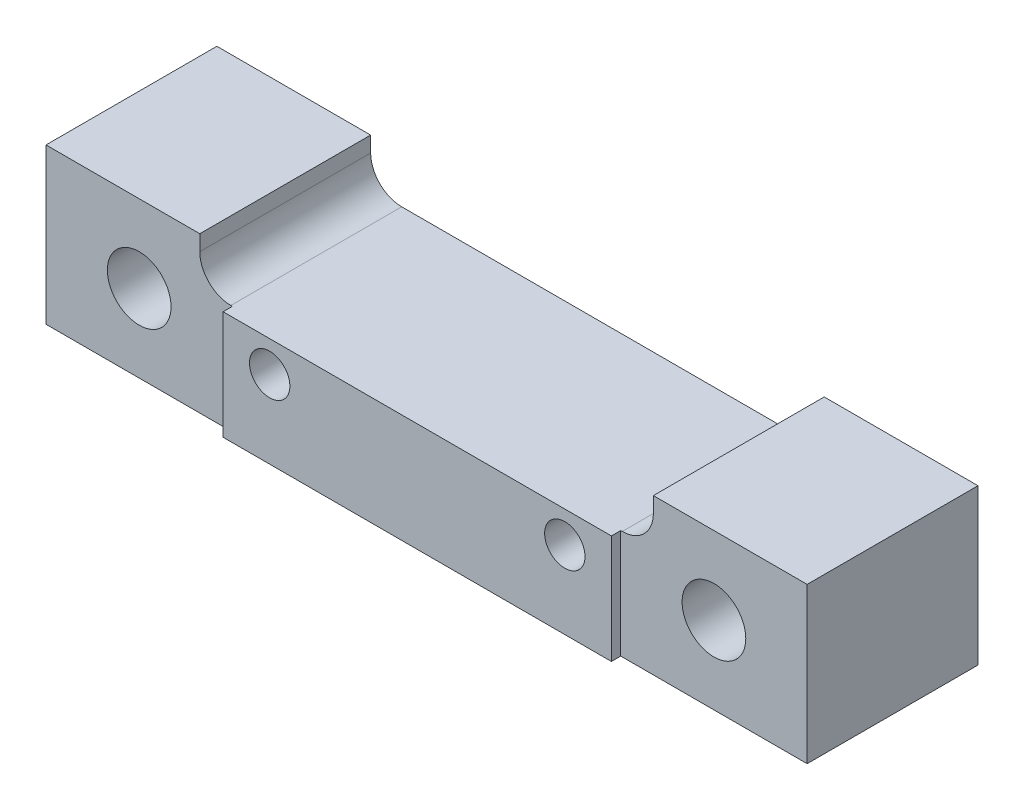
ISO-10303-21;
HEADER;
FILE_DESCRIPTION(('STEP AP214'),'2;1');
FILE_NAME('part.step','',(''),(''),'','','');
FILE_SCHEMA(('AUTOMOTIVE_DESIGN { 1 0 10303 214 1 1 1 1 }'));
ENDSEC;
DATA;
#1=APPLICATION_CONTEXT('core data for automotive mechanical design processes');
#2=APPLICATION_PROTOCOL_DEFINITION('international standard','automotive_design',2000,#1);
#3=PRODUCT_CONTEXT('',#1,'mechanical');
#4=PRODUCT('Part','Part','',(#3));
#5=PRODUCT_RELATED_PRODUCT_CATEGORY('part','',(#4));
#6=PRODUCT_DEFINITION_FORMATION('','',#4);
#7=PRODUCT_DEFINITION_CONTEXT('part definition',#1,'design');
#8=PRODUCT_DEFINITION('design','',#6,#7);
#9=PRODUCT_DEFINITION_SHAPE('','',#8);
#10=(LENGTH_UNIT() NAMED_UNIT(*) SI_UNIT(.MILLI.,.METRE.));
#11=(NAMED_UNIT(*) PLANE_ANGLE_UNIT() SI_UNIT($,.RADIAN.));
#12=(NAMED_UNIT(*) SI_UNIT($,.STERADIAN.) SOLID_ANGLE_UNIT());
#13=UNCERTAINTY_MEASURE_WITH_UNIT(LENGTH_MEASURE(1.E-05),#10,'distance_accuracy_value','');
#14=(GEOMETRIC_REPRESENTATION_CONTEXT(3) GLOBAL_UNCERTAINTY_ASSIGNED_CONTEXT((#13)) GLOBAL_UNIT_ASSIGNED_CONTEXT((#10,
#11,#12)) REPRESENTATION_CONTEXT('',''));
#15=CARTESIAN_POINT('',(0.,0.,0.));
#16=DIRECTION('',(0.,0.,1.));
#17=DIRECTION('',(1.,0.,0.));
#18=AXIS2_PLACEMENT_3D('',#15,#16,#17);
#19=CARTESIAN_POINT('',(-63.0000000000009,20.0000000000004,-4.16333634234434E-13));
#20=DIRECTION('',(0.,0.,-1.));
#21=DIRECTION('',(-1.00000000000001,0.,0.));
#22=AXIS2_PLACEMENT_3D('',#19,#20,#21);
#23=PLANE('',#22);
#24=CARTESIAN_POINT('',(47.5000000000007,1.66533453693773E-13,-3.60822483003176E-13));
#25=DIRECTION('',(0.,0.,-1.));
#26=DIRECTION('',(1.00000000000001,0.,0.));
#27=AXIS2_PLACEMENT_3D('',#24,#25,#26);
#28=CIRCLE('',#27,6.5);
#29=CARTESIAN_POINT('',(54.0000000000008,1.66533453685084E-13,-3.59683637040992E-13));
#30=VERTEX_POINT('',#29);
#31=EDGE_CURVE('E376',#30,#30,#28,.T.);
#32=ORIENTED_EDGE('',*,*,#31,.F.);
#33=EDGE_LOOP('',(#32));
#34=FACE_BOUND('',#33,.T.);
#35=CARTESIAN_POINT('',(-47.5000000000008,1.80411241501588E-13,0.));
#36=DIRECTION('',(0.,0.,-1.));
#37=DIRECTION('',(-1.00000000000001,0.,0.));
#38=AXIS2_PLACEMENT_3D('',#35,#36,#37);
#39=CIRCLE('',#38,6.5);
#40=CARTESIAN_POINT('',(-54.0000000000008,1.80411241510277E-13,0.));
#41=VERTEX_POINT('',#40);
#42=EDGE_CURVE('E378',#41,#41,#39,.T.);
#43=ORIENTED_EDGE('',*,*,#42,.F.);
#44=EDGE_LOOP('',(#43));
#45=FACE_BOUND('',#44,.T.);
#46=CARTESIAN_POINT('',(-92.500000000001,2.28983498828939E-13,0.));
#47=DIRECTION('',(0.,0.,1.));
#48=DIRECTION('',(1.00000000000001,0.,0.));
#49=AXIS2_PLACEMENT_3D('',#46,#47,#48);
#50=CIRCLE('',#49,10.25);
#51=CARTESIAN_POINT('',(-82.2500000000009,2.26707541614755E-13,0.));
#52=VERTEX_POINT('',#51);
#53=EDGE_CURVE('E229',#52,#52,#50,.T.);
#54=ORIENTED_EDGE('',*,*,#53,.T.);
#55=EDGE_LOOP('',(#54));
#56=FACE_BOUND('',#55,.T.);
#57=DIRECTION('',(0.,-1.00000000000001,0.));
#58=VECTOR('',#57,1.);
#59=CARTESIAN_POINT('',(-122.500000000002,-25.0000000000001,0.));
#60=LINE('',#59,#58);
#61=CARTESIAN_POINT('',(-122.500000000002,25.0000000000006,0.));
#62=VERTEX_POINT('',#61);
#63=CARTESIAN_POINT('',(-122.500000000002,-25.0000000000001,0.));
#64=VERTEX_POINT('',#63);
#65=EDGE_CURVE('E232',#62,#64,#60,.T.);
#66=ORIENTED_EDGE('',*,*,#65,.F.);
#67=DIRECTION('',(-1.00000000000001,0.,0.));
#68=VECTOR('',#67,1.);
#69=CARTESIAN_POINT('',(-122.500000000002,25.0000000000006,0.));
#70=LINE('',#69,#68);
#71=CARTESIAN_POINT('',(-73.0000000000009,25.0000000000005,0.));
#72=VERTEX_POINT('',#71);
#73=EDGE_CURVE('E166',#72,#62,#70,.T.);
#74=ORIENTED_EDGE('',*,*,#73,.F.);
#75=DIRECTION('',(0.,1.00000000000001,0.));
#76=VECTOR('',#75,1.);
#77=CARTESIAN_POINT('',(-73.0000000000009,25.0000000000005,0.));
#78=LINE('',#77,#76);
#79=CARTESIAN_POINT('',(-73.000000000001,20.0000000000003,0.));
#80=VERTEX_POINT('',#79);
#81=EDGE_CURVE('E171',#80,#72,#78,.T.);
#82=ORIENTED_EDGE('',*,*,#81,.F.);
#83=CARTESIAN_POINT('',(-63.0000000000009,20.0000000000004,-4.16333634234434E-13));
#84=DIRECTION('',(0.,0.,-1.));
#85=DIRECTION('',(-1.00000000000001,0.,0.));
#86=AXIS2_PLACEMENT_3D('',#83,#84,#85);
#87=CIRCLE('',#86,10.);
#88=CARTESIAN_POINT('',(-63.0000000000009,10.0000000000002,0.));
#89=VERTEX_POINT('',#88);
#90=EDGE_CURVE('E253',#89,#80,#87,.T.);
#91=ORIENTED_EDGE('',*,*,#90,.F.);
#92=DIRECTION('',(-1.00000000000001,0.,0.));
#93=VECTOR('',#92,1.);
#94=CARTESIAN_POINT('',(-63.0000000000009,10.0000000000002,0.));
#95=LINE('',#94,#93);
#96=CARTESIAN_POINT('',(63.0000000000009,10.0000000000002,0.));
#97=VERTEX_POINT('',#96);
#98=EDGE_CURVE('E250',#97,#89,#95,.T.);
#99=ORIENTED_EDGE('',*,*,#98,.F.);
#100=CARTESIAN_POINT('',(63.0000000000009,20.0000000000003,0.));
#101=DIRECTION('',(0.,0.,-1.));
#102=DIRECTION('',(-1.00000000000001,0.,0.));
#103=AXIS2_PLACEMENT_3D('',#100,#101,#102);
#104=CIRCLE('',#103,10.);
#105=CARTESIAN_POINT('',(73.0000000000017,20.0000000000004,0.));
#106=VERTEX_POINT('',#105);
#107=EDGE_CURVE('E247',#106,#97,#104,.T.);
#108=ORIENTED_EDGE('',*,*,#107,.F.);
#109=DIRECTION('',(0.,-1.00000000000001,0.));
#110=VECTOR('',#109,1.);
#111=CARTESIAN_POINT('',(73.0000000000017,20.0000000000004,0.));
#112=LINE('',#111,#110);
#113=CARTESIAN_POINT('',(73.0000000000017,25.0000000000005,0.));
#114=VERTEX_POINT('',#113);
#115=EDGE_CURVE('E244',#114,#106,#112,.T.);
#116=ORIENTED_EDGE('',*,*,#115,.F.);
#117=DIRECTION('',(-1.00000000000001,0.,0.));
#118=VECTOR('',#117,1.);
#119=CARTESIAN_POINT('',(73.0000000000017,25.0000000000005,0.));
#120=LINE('',#119,#118);
#121=CARTESIAN_POINT('',(122.500000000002,25.0000000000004,-3.7470027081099E-13));
#122=VERTEX_POINT('',#121);
#123=EDGE_CURVE('E241',#122,#114,#120,.T.);
#124=ORIENTED_EDGE('',*,*,#123,.F.);
#125=DIRECTION('',(0.,1.00000000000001,0.));
#126=VECTOR('',#125,1.);
#127=CARTESIAN_POINT('',(122.500000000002,-25.0000000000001,-3.88578058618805E-13));
#128=LINE('',#127,#126);
#129=CARTESIAN_POINT('',(122.500000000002,-25.0000000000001,-3.88578058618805E-13));
#130=VERTEX_POINT('',#129);
#131=EDGE_CURVE('E238',#130,#122,#128,.T.);
#132=ORIENTED_EDGE('',*,*,#131,.F.);
#133=DIRECTION('',(1.00000000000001,0.,0.));
#134=VECTOR('',#133,1.);
#135=CARTESIAN_POINT('',(-122.500000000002,-25.0000000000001,0.));
#136=LINE('',#135,#134);
#137=EDGE_CURVE('E235',#64,#130,#136,.T.);
#138=ORIENTED_EDGE('',*,*,#137,.F.);
#139=EDGE_LOOP('',(#66,#74,#82,#91,#99,#108,#116,#124,#132,#138));
#140=FACE_BOUND('',#139,.T.);
#141=CARTESIAN_POINT('',(92.5000000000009,0.,-4.02455846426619E-13));
#142=DIRECTION('',(0.,0.,1.));
#143=DIRECTION('',(1.00000000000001,0.,0.));
#144=AXIS2_PLACEMENT_3D('',#141,#142,#143);
#145=CIRCLE('',#144,10.25);
#146=CARTESIAN_POINT('',(102.750000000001,0.,-4.00944468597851E-13));
#147=VERTEX_POINT('',#146);
#148=EDGE_CURVE('E226',#147,#147,#145,.T.);
#149=ORIENTED_EDGE('',*,*,#148,.T.);
#150=EDGE_LOOP('',(#149));
#151=FACE_BOUND('',#150,.T.);
#152=ADVANCED_FACE('F38',(#34,#45,#56,#140,#151),#23,.T.);
#153=CARTESIAN_POINT('',(122.500000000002,-25.0000000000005,58.));
#154=DIRECTION('',(-1.00000000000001,0.,0.));
#155=DIRECTION('',(0.,0.,1.));
#156=AXIS2_PLACEMENT_3D('',#153,#154,#155);
#157=PLANE('',#156);
#158=DIRECTION('',(0.,1.00000000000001,0.));
#159=VECTOR('',#158,1.);
#160=CARTESIAN_POINT('',(122.500000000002,-25.,55.));
#161=LINE('',#160,#159);
#162=CARTESIAN_POINT('',(122.500000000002,-25.,55.));
#163=VERTEX_POINT('',#162);
#164=CARTESIAN_POINT('',(122.500000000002,25.0000000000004,55.));
#165=VERTEX_POINT('',#164);
#166=EDGE_CURVE('E149',#163,#165,#161,.T.);
#167=ORIENTED_EDGE('',*,*,#166,.F.);
#168=DIRECTION('',(0.,0.,-1.));
#169=VECTOR('',#168,1.);
#170=CARTESIAN_POINT('',(122.500000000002,-25.0000000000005,58.));
#171=LINE('',#170,#169);
#172=EDGE_CURVE('E190',#163,#130,#171,.T.);
#173=ORIENTED_EDGE('',*,*,#172,.T.);
#174=ORIENTED_EDGE('',*,*,#131,.T.);
#175=DIRECTION('',(0.,0.,-1.));
#176=VECTOR('',#175,1.);
#177=CARTESIAN_POINT('',(122.500000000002,25.0000000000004,58.));
#178=LINE('',#177,#176);
#179=EDGE_CURVE('E188',#165,#122,#178,.T.);
#180=ORIENTED_EDGE('',*,*,#179,.F.);
#181=EDGE_LOOP('',(#167,#173,#174,#180));
#182=FACE_BOUND('',#181,.T.);
#183=ADVANCED_FACE('F281',(#182),#157,.F.);
#184=CARTESIAN_POINT('',(73.0000000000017,25.0000000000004,58.));
#185=DIRECTION('',(0.,-1.00000000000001,0.));
#186=DIRECTION('',(1.00000000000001,0.,0.));
#187=AXIS2_PLACEMENT_3D('',#184,#185,#186);
#188=PLANE('',#187);
#189=DIRECTION('',(-1.00000000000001,0.,0.));
#190=VECTOR('',#189,1.);
#191=CARTESIAN_POINT('',(122.500000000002,25.0000000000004,55.));
#192=LINE('',#191,#190);
#193=CARTESIAN_POINT('',(73.0000000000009,25.0000000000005,55.));
#194=VERTEX_POINT('',#193);
#195=EDGE_CURVE('E283',#165,#194,#192,.T.);
#196=ORIENTED_EDGE('',*,*,#195,.F.);
#197=ORIENTED_EDGE('',*,*,#179,.T.);
#198=ORIENTED_EDGE('',*,*,#123,.T.);
#199=DIRECTION('',(0.,0.,-1.));
#200=VECTOR('',#199,1.);
#201=CARTESIAN_POINT('',(73.0000000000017,25.0000000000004,58.));
#202=LINE('',#201,#200);
#203=EDGE_CURVE('E186',#194,#114,#202,.T.);
#204=ORIENTED_EDGE('',*,*,#203,.F.);
#205=EDGE_LOOP('',(#196,#197,#198,#204));
#206=FACE_BOUND('',#205,.T.);
#207=ADVANCED_FACE('F310',(#206),#188,.F.);
#208=CARTESIAN_POINT('',(73.0000000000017,20.0000000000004,58.));
#209=DIRECTION('',(1.00000000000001,0.,0.));
#210=DIRECTION('',(0.,0.,-1.));
#211=AXIS2_PLACEMENT_3D('',#208,#209,#210);
#212=PLANE('',#211);
#213=DIRECTION('',(0.,-1.00000000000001,0.));
#214=VECTOR('',#213,1.);
#215=CARTESIAN_POINT('',(73.0000000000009,20.0000000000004,55.));
#216=LINE('',#215,#214);
#217=CARTESIAN_POINT('',(73.0000000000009,20.0000000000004,55.));
#218=VERTEX_POINT('',#217);
#219=EDGE_CURVE('E204',#194,#218,#216,.T.);
#220=ORIENTED_EDGE('',*,*,#219,.F.);
#221=ORIENTED_EDGE('',*,*,#203,.T.);
#222=ORIENTED_EDGE('',*,*,#115,.T.);
#223=DIRECTION('',(0.,0.,-1.));
#224=VECTOR('',#223,1.);
#225=CARTESIAN_POINT('',(73.0000000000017,20.0000000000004,58.));
#226=LINE('',#225,#224);
#227=EDGE_CURVE('E184',#218,#106,#226,.T.);
#228=ORIENTED_EDGE('',*,*,#227,.F.);
#229=EDGE_LOOP('',(#220,#221,#222,#228));
#230=FACE_BOUND('',#229,.T.);
#231=ADVANCED_FACE('F307',(#230),#212,.F.);
#232=CARTESIAN_POINT('',(63.0000000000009,20.0000000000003,58.));
#233=DIRECTION('',(0.,0.,-1.));
#234=DIRECTION('',(-1.00000000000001,0.,0.));
#235=AXIS2_PLACEMENT_3D('',#232,#233,#234);
#236=CYLINDRICAL_SURFACE('',#235,10.);
#237=CARTESIAN_POINT('',(63.0000000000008,20.0000000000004,55.));
#238=DIRECTION('',(0.,0.,1.));
#239=DIRECTION('',(1.00000000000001,0.,0.));
#240=AXIS2_PLACEMENT_3D('',#237,#238,#239);
#241=CIRCLE('',#240,10.);
#242=CARTESIAN_POINT('',(63.0000000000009,10.0000000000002,55.));
#243=VERTEX_POINT('',#242);
#244=EDGE_CURVE('E53',#218,#243,#241,.F.);
#245=ORIENTED_EDGE('',*,*,#244,.F.);
#246=ORIENTED_EDGE('',*,*,#227,.T.);
#247=ORIENTED_EDGE('',*,*,#107,.T.);
#248=DIRECTION('',(0.,0.,-1.));
#249=VECTOR('',#248,1.);
#250=CARTESIAN_POINT('',(63.0000000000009,10.0000000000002,58.));
#251=LINE('',#250,#249);
#252=EDGE_CURVE('E182',#243,#97,#251,.T.);
#253=ORIENTED_EDGE('',*,*,#252,.F.);
#254=EDGE_LOOP('',(#245,#246,#247,#253));
#255=FACE_BOUND('',#254,.T.);
#256=ADVANCED_FACE('F303',(#255),#236,.F.);
#257=CARTESIAN_POINT('',(92.5000000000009,1.80411241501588E-13,58.));
#258=DIRECTION('',(0.,0.,-1.));
#259=DIRECTION('',(-1.00000000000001,0.,0.));
#260=AXIS2_PLACEMENT_3D('',#257,#258,#259);
#261=CYLINDRICAL_SURFACE('',#260,10.25);
#262=ORIENTED_EDGE('',*,*,#148,.F.);
#263=EDGE_LOOP('',(#262));
#264=FACE_BOUND('',#263,.T.);
#265=CARTESIAN_POINT('',(92.5000000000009,1.94289029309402E-13,55.));
#266=DIRECTION('',(0.,0.,1.));
#267=DIRECTION('',(1.00000000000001,0.,0.));
#268=AXIS2_PLACEMENT_3D('',#265,#266,#267);
#269=CIRCLE('',#268,10.25);
#270=CARTESIAN_POINT('',(102.750000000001,1.92013072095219E-13,55.));
#271=VERTEX_POINT('',#270);
#272=EDGE_CURVE('E159',#271,#271,#269,.T.);
#273=ORIENTED_EDGE('',*,*,#272,.T.);
#274=EDGE_LOOP('',(#273));
#275=FACE_BOUND('',#274,.T.);
#276=ADVANCED_FACE('F342',(#264,#275),#261,.F.);
#277=CARTESIAN_POINT('',(-122.500000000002,-25.,58.));
#278=DIRECTION('',(1.00000000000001,0.,0.));
#279=DIRECTION('',(0.,0.,-1.));
#280=AXIS2_PLACEMENT_3D('',#277,#278,#279);
#281=PLANE('',#280);
#282=DIRECTION('',(0.,-1.00000000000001,0.));
#283=VECTOR('',#282,1.);
#284=CARTESIAN_POINT('',(-122.500000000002,25.0000000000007,55.));
#285=LINE('',#284,#283);
#286=CARTESIAN_POINT('',(-122.500000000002,25.0000000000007,55.));
#287=VERTEX_POINT('',#286);
#288=CARTESIAN_POINT('',(-122.500000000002,-25.,55.));
#289=VERTEX_POINT('',#288);
#290=EDGE_CURVE('E210',#287,#289,#285,.T.);
#291=ORIENTED_EDGE('',*,*,#290,.F.);
#292=DIRECTION('',(0.,0.,-1.));
#293=VECTOR('',#292,1.);
#294=CARTESIAN_POINT('',(-122.500000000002,25.0000000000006,58.));
#295=LINE('',#294,#293);
#296=EDGE_CURVE('E168',#287,#62,#295,.T.);
#297=ORIENTED_EDGE('',*,*,#296,.T.);
#298=ORIENTED_EDGE('',*,*,#65,.T.);
#299=DIRECTION('',(0.,0.,-1.));
#300=VECTOR('',#299,1.);
#301=CARTESIAN_POINT('',(-122.500000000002,-25.,58.));
#302=LINE('',#301,#300);
#303=EDGE_CURVE('E192',#289,#64,#302,.T.);
#304=ORIENTED_EDGE('',*,*,#303,.F.);
#305=EDGE_LOOP('',(#291,#297,#298,#304));
#306=FACE_BOUND('',#305,.T.);
#307=ADVANCED_FACE('F40',(#306),#281,.F.);
#308=CARTESIAN_POINT('',(-63.0000000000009,20.0000000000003,58.));
#309=DIRECTION('',(0.,0.,-1.));
#310=DIRECTION('',(-1.00000000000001,0.,0.));
#311=AXIS2_PLACEMENT_3D('',#308,#309,#310);
#312=CYLINDRICAL_SURFACE('',#311,10.);
#313=CARTESIAN_POINT('',(-63.000000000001,20.0000000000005,55.));
#314=DIRECTION('',(0.,0.,1.));
#315=DIRECTION('',(1.00000000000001,0.,0.));
#316=AXIS2_PLACEMENT_3D('',#313,#314,#315);
#317=CIRCLE('',#316,10.);
#318=CARTESIAN_POINT('',(-63.0000000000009,10.0000000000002,55.));
#319=VERTEX_POINT('',#318);
#320=CARTESIAN_POINT('',(-73.0000000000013,20.0000000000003,55.));
#321=VERTEX_POINT('',#320);
#322=EDGE_CURVE('E222',#319,#321,#317,.F.);
#323=ORIENTED_EDGE('',*,*,#322,.F.);
#324=DIRECTION('',(0.,0.,-1.));
#325=VECTOR('',#324,1.);
#326=CARTESIAN_POINT('',(-63.0000000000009,10.0000000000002,58.));
#327=LINE('',#326,#325);
#328=EDGE_CURVE('E180',#319,#89,#327,.T.);
#329=ORIENTED_EDGE('',*,*,#328,.T.);
#330=ORIENTED_EDGE('',*,*,#90,.T.);
#331=DIRECTION('',(0.,0.,-1.));
#332=VECTOR('',#331,1.);
#333=CARTESIAN_POINT('',(-73.000000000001,20.0000000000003,58.));
#334=LINE('',#333,#332);
#335=EDGE_CURVE('E178',#321,#80,#334,.T.);
#336=ORIENTED_EDGE('',*,*,#335,.F.);
#337=EDGE_LOOP('',(#323,#329,#330,#336));
#338=FACE_BOUND('',#337,.T.);
#339=ADVANCED_FACE('F300',(#338),#312,.F.);
#340=CARTESIAN_POINT('',(-73.0000000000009,25.0000000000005,58.));
#341=DIRECTION('',(-1.00000000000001,0.,0.));
#342=DIRECTION('',(0.,0.,1.));
#343=AXIS2_PLACEMENT_3D('',#340,#341,#342);
#344=PLANE('',#343);
#345=DIRECTION('',(0.,1.00000000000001,0.));
#346=VECTOR('',#345,1.);
#347=CARTESIAN_POINT('',(-73.000000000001,25.0000000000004,55.));
#348=LINE('',#347,#346);
#349=CARTESIAN_POINT('',(-73.000000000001,25.0000000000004,55.));
#350=VERTEX_POINT('',#349);
#351=EDGE_CURVE('E61',#321,#350,#348,.T.);
#352=ORIENTED_EDGE('',*,*,#351,.F.);
#353=ORIENTED_EDGE('',*,*,#335,.T.);
#354=ORIENTED_EDGE('',*,*,#81,.T.);
#355=DIRECTION('',(0.,0.,-1.));
#356=VECTOR('',#355,1.);
#357=CARTESIAN_POINT('',(-73.0000000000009,25.0000000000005,58.));
#358=LINE('',#357,#356);
#359=EDGE_CURVE('E176',#350,#72,#358,.T.);
#360=ORIENTED_EDGE('',*,*,#359,.F.);
#361=EDGE_LOOP('',(#352,#353,#354,#360));
#362=FACE_BOUND('',#361,.T.);
#363=ADVANCED_FACE('F260',(#362),#344,.F.);
#364=CARTESIAN_POINT('',(-122.500000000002,25.0000000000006,58.));
#365=DIRECTION('',(0.,-1.00000000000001,0.));
#366=DIRECTION('',(1.00000000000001,0.,0.));
#367=AXIS2_PLACEMENT_3D('',#364,#365,#366);
#368=PLANE('',#367);
#369=DIRECTION('',(-1.00000000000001,0.,0.));
#370=VECTOR('',#369,1.);
#371=CARTESIAN_POINT('',(-122.500000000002,25.0000000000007,55.));
#372=LINE('',#371,#370);
#373=EDGE_CURVE('E218',#350,#287,#372,.T.);
#374=ORIENTED_EDGE('',*,*,#373,.F.);
#375=ORIENTED_EDGE('',*,*,#359,.T.);
#376=ORIENTED_EDGE('',*,*,#73,.T.);
#377=ORIENTED_EDGE('',*,*,#296,.F.);
#378=EDGE_LOOP('',(#374,#375,#376,#377));
#379=FACE_BOUND('',#378,.T.);
#380=ADVANCED_FACE('F269',(#379),#368,.F.);
#381=CARTESIAN_POINT('',(-92.500000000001,2.22044604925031E-13,58.));
#382=DIRECTION('',(0.,0.,-1.));
#383=DIRECTION('',(-1.00000000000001,0.,0.));
#384=AXIS2_PLACEMENT_3D('',#381,#382,#383);
#385=CYLINDRICAL_SURFACE('',#384,10.25);
#386=ORIENTED_EDGE('',*,*,#53,.F.);
#387=EDGE_LOOP('',(#386));
#388=FACE_BOUND('',#387,.T.);
#389=CARTESIAN_POINT('',(-92.500000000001,2.28983498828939E-13,55.));
#390=DIRECTION('',(0.,0.,1.));
#391=DIRECTION('',(1.00000000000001,0.,0.));
#392=AXIS2_PLACEMENT_3D('',#389,#390,#391);
#393=CIRCLE('',#392,10.25);
#394=CARTESIAN_POINT('',(-82.2500000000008,2.26707541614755E-13,55.));
#395=VERTEX_POINT('',#394);
#396=EDGE_CURVE('E194',#395,#395,#393,.T.);
#397=ORIENTED_EDGE('',*,*,#396,.T.);
#398=EDGE_LOOP('',(#397));
#399=FACE_BOUND('',#398,.T.);
#400=ADVANCED_FACE('F328',(#388,#399),#385,.F.);
#401=CARTESIAN_POINT('',(-63.0000000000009,20.0000000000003,58.));
#402=DIRECTION('',(0.,0.,-1.));
#403=DIRECTION('',(-1.00000000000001,0.,0.));
#404=AXIS2_PLACEMENT_3D('',#401,#402,#403);
#405=PLANE('',#404);
#406=CARTESIAN_POINT('',(47.5000000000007,1.66533453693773E-13,58.));
#407=DIRECTION('',(0.,0.,-1.));
#408=DIRECTION('',(1.00000000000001,0.,0.));
#409=AXIS2_PLACEMENT_3D('',#406,#407,#408);
#410=CIRCLE('',#409,6.5);
#411=CARTESIAN_POINT('',(54.0000000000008,1.66533453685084E-13,58.));
#412=VERTEX_POINT('',#411);
#413=EDGE_CURVE('E374',#412,#412,#410,.T.);
#414=ORIENTED_EDGE('',*,*,#413,.T.);
#415=EDGE_LOOP('',(#414));
#416=FACE_BOUND('',#415,.T.);
#417=CARTESIAN_POINT('',(-47.5000000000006,0.,58.));
#418=DIRECTION('',(0.,0.,-1.));
#419=DIRECTION('',(-1.00000000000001,0.,0.));
#420=AXIS2_PLACEMENT_3D('',#417,#418,#419);
#421=CIRCLE('',#420,6.5);
#422=CARTESIAN_POINT('',(-54.0000000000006,0.,58.));
#423=VERTEX_POINT('',#422);
#424=EDGE_CURVE('E150',#423,#423,#421,.T.);
#425=ORIENTED_EDGE('',*,*,#424,.T.);
#426=EDGE_LOOP('',(#425));
#427=FACE_BOUND('',#426,.T.);
#428=DIRECTION('',(1.00000000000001,0.,0.));
#429=VECTOR('',#428,1.);
#430=CARTESIAN_POINT('',(-122.500000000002,-25.,58.));
#431=LINE('',#430,#429);
#432=CARTESIAN_POINT('',(-62.500000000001,-25.,58.));
#433=VERTEX_POINT('',#432);
#434=CARTESIAN_POINT('',(62.5000000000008,-25.0000000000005,58.));
#435=VERTEX_POINT('',#434);
#436=EDGE_CURVE('E156',#433,#435,#431,.T.);
#437=ORIENTED_EDGE('',*,*,#436,.T.);
#438=DIRECTION('',(0.,-1.00000000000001,0.));
#439=VECTOR('',#438,1.);
#440=CARTESIAN_POINT('',(62.5000000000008,-25.0000000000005,58.));
#441=LINE('',#440,#439);
#442=CARTESIAN_POINT('',(62.5000000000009,10.0000000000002,58.));
#443=VERTEX_POINT('',#442);
#444=EDGE_CURVE('E140',#443,#435,#441,.T.);
#445=ORIENTED_EDGE('',*,*,#444,.F.);
#446=DIRECTION('',(-1.00000000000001,0.,0.));
#447=VECTOR('',#446,1.);
#448=CARTESIAN_POINT('',(-63.0000000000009,10.0000000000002,58.));
#449=LINE('',#448,#447);
#450=CARTESIAN_POINT('',(-62.5000000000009,10.0000000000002,58.));
#451=VERTEX_POINT('',#450);
#452=EDGE_CURVE('E165',#443,#451,#449,.T.);
#453=ORIENTED_EDGE('',*,*,#452,.T.);
#454=DIRECTION('',(0.,1.00000000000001,0.));
#455=VECTOR('',#454,1.);
#456=CARTESIAN_POINT('',(-62.5000000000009,25.0000000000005,58.));
#457=LINE('',#456,#455);
#458=EDGE_CURVE('E164',#433,#451,#457,.T.);
#459=ORIENTED_EDGE('',*,*,#458,.F.);
#460=EDGE_LOOP('',(#437,#445,#453,#459));
#461=FACE_BOUND('',#460,.T.);
#462=ADVANCED_FACE('F162',(#416,#427,#461),#405,.F.);
#463=CARTESIAN_POINT('',(-122.500000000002,-25.,58.));
#464=DIRECTION('',(0.,1.00000000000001,0.));
#465=DIRECTION('',(0.,0.,1.));
#466=AXIS2_PLACEMENT_3D('',#463,#464,#465);
#467=PLANE('',#466);
#468=DIRECTION('',(1.00000000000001,0.,0.));
#469=VECTOR('',#468,1.);
#470=CARTESIAN_POINT('',(122.500000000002,-25.,55.));
#471=LINE('',#470,#469);
#472=CARTESIAN_POINT('',(62.5000000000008,-25.0000000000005,55.));
#473=VERTEX_POINT('',#472);
#474=EDGE_CURVE('E158',#473,#163,#471,.T.);
#475=ORIENTED_EDGE('',*,*,#474,.F.);
#476=DIRECTION('',(0.,0.,1.));
#477=VECTOR('',#476,1.);
#478=CARTESIAN_POINT('',(62.5000000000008,-25.0000000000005,55.));
#479=LINE('',#478,#477);
#480=EDGE_CURVE('E144',#473,#435,#479,.T.);
#481=ORIENTED_EDGE('',*,*,#480,.T.);
#482=ORIENTED_EDGE('',*,*,#436,.F.);
#483=DIRECTION('',(0.,0.,1.));
#484=VECTOR('',#483,1.);
#485=CARTESIAN_POINT('',(-62.5000000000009,-25.,55.));
#486=LINE('',#485,#484);
#487=CARTESIAN_POINT('',(-62.5000000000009,-25.,55.));
#488=VERTEX_POINT('',#487);
#489=EDGE_CURVE('E197',#488,#433,#486,.T.);
#490=ORIENTED_EDGE('',*,*,#489,.F.);
#491=DIRECTION('',(1.00000000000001,0.,0.));
#492=VECTOR('',#491,1.);
#493=CARTESIAN_POINT('',(-122.500000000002,-25.,55.));
#494=LINE('',#493,#492);
#495=EDGE_CURVE('E212',#289,#488,#494,.T.);
#496=ORIENTED_EDGE('',*,*,#495,.F.);
#497=ORIENTED_EDGE('',*,*,#303,.T.);
#498=ORIENTED_EDGE('',*,*,#137,.T.);
#499=ORIENTED_EDGE('',*,*,#172,.F.);
#500=EDGE_LOOP('',(#475,#481,#482,#490,#496,#497,#498,#499));
#501=FACE_BOUND('',#500,.T.);
#502=ADVANCED_FACE('F154',(#501),#467,.F.);
#503=CARTESIAN_POINT('',(-63.0000000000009,10.0000000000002,58.));
#504=DIRECTION('',(0.,-1.00000000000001,0.));
#505=DIRECTION('',(1.00000000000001,0.,0.));
#506=AXIS2_PLACEMENT_3D('',#503,#504,#505);
#507=PLANE('',#506);
#508=ORIENTED_EDGE('',*,*,#452,.F.);
#509=DIRECTION('',(0.,0.,-1.));
#510=VECTOR('',#509,1.);
#511=CARTESIAN_POINT('',(62.5000000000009,10.0000000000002,58.));
#512=LINE('',#511,#510);
#513=CARTESIAN_POINT('',(62.5000000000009,10.0000000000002,55.));
#514=VERTEX_POINT('',#513);
#515=EDGE_CURVE('E11',#443,#514,#512,.T.);
#516=ORIENTED_EDGE('',*,*,#515,.T.);
#517=DIRECTION('',(-1.00000000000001,0.,0.));
#518=VECTOR('',#517,1.);
#519=CARTESIAN_POINT('',(-63.0000000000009,10.0000000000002,55.));
#520=LINE('',#519,#518);
#521=EDGE_CURVE('E200',#243,#514,#520,.T.);
#522=ORIENTED_EDGE('',*,*,#521,.F.);
#523=ORIENTED_EDGE('',*,*,#252,.T.);
#524=ORIENTED_EDGE('',*,*,#98,.T.);
#525=ORIENTED_EDGE('',*,*,#328,.F.);
#526=DIRECTION('',(-1.00000000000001,0.,0.));
#527=VECTOR('',#526,1.);
#528=CARTESIAN_POINT('',(-63.0000000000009,10.0000000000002,55.));
#529=LINE('',#528,#527);
#530=CARTESIAN_POINT('',(-62.5000000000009,10.0000000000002,55.));
#531=VERTEX_POINT('',#530);
#532=EDGE_CURVE('E224',#531,#319,#529,.T.);
#533=ORIENTED_EDGE('',*,*,#532,.F.);
#534=DIRECTION('',(0.,0.,1.));
#535=VECTOR('',#534,1.);
#536=CARTESIAN_POINT('',(-62.5000000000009,10.0000000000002,58.));
#537=LINE('',#536,#535);
#538=EDGE_CURVE('E46',#531,#451,#537,.T.);
#539=ORIENTED_EDGE('',*,*,#538,.T.);
#540=EDGE_LOOP('',(#508,#516,#522,#523,#524,#525,#533,#539));
#541=FACE_BOUND('',#540,.T.);
#542=ADVANCED_FACE('F291',(#541),#507,.F.);
#543=CARTESIAN_POINT('',(-62.5000000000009,25.0000000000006,55.));
#544=DIRECTION('',(1.00000000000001,0.,0.));
#545=DIRECTION('',(0.,1.00000000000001,0.));
#546=AXIS2_PLACEMENT_3D('',#543,#544,#545);
#547=PLANE('',#546);
#548=DIRECTION('',(0.,1.00000000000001,0.));
#549=VECTOR('',#548,1.);
#550=CARTESIAN_POINT('',(-62.5000000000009,25.0000000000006,55.));
#551=LINE('',#550,#549);
#552=EDGE_CURVE('E215',#488,#531,#551,.T.);
#553=ORIENTED_EDGE('',*,*,#552,.F.);
#554=ORIENTED_EDGE('',*,*,#489,.T.);
#555=ORIENTED_EDGE('',*,*,#458,.T.);
#556=ORIENTED_EDGE('',*,*,#538,.F.);
#557=EDGE_LOOP('',(#553,#554,#555,#556));
#558=FACE_BOUND('',#557,.T.);
#559=ADVANCED_FACE('F295',(#558),#547,.F.);
#560=CARTESIAN_POINT('',(-122.500000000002,-25.,55.));
#561=DIRECTION('',(0.,0.,1.));
#562=DIRECTION('',(1.00000000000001,0.,0.));
#563=AXIS2_PLACEMENT_3D('',#560,#561,#562);
#564=PLANE('',#563);
#565=ORIENTED_EDGE('',*,*,#396,.F.);
#566=EDGE_LOOP('',(#565));
#567=FACE_BOUND('',#566,.T.);
#568=ORIENTED_EDGE('',*,*,#532,.T.);
#569=ORIENTED_EDGE('',*,*,#322,.T.);
#570=ORIENTED_EDGE('',*,*,#351,.T.);
#571=ORIENTED_EDGE('',*,*,#373,.T.);
#572=ORIENTED_EDGE('',*,*,#290,.T.);
#573=ORIENTED_EDGE('',*,*,#495,.T.);
#574=ORIENTED_EDGE('',*,*,#552,.T.);
#575=EDGE_LOOP('',(#568,#569,#570,#571,#572,#573,#574));
#576=FACE_BOUND('',#575,.T.);
#577=ADVANCED_FACE('F271',(#567,#576),#564,.T.);
#578=CARTESIAN_POINT('',(62.5000000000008,-25.0000000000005,55.));
#579=DIRECTION('',(-1.00000000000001,0.,0.));
#580=DIRECTION('',(0.,0.,1.));
#581=AXIS2_PLACEMENT_3D('',#578,#579,#580);
#582=PLANE('',#581);
#583=ORIENTED_EDGE('',*,*,#444,.T.);
#584=ORIENTED_EDGE('',*,*,#480,.F.);
#585=DIRECTION('',(0.,-1.00000000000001,0.));
#586=VECTOR('',#585,1.);
#587=CARTESIAN_POINT('',(62.5000000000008,-25.0000000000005,55.));
#588=LINE('',#587,#586);
#589=EDGE_CURVE('E285',#514,#473,#588,.T.);
#590=ORIENTED_EDGE('',*,*,#589,.F.);
#591=ORIENTED_EDGE('',*,*,#515,.F.);
#592=EDGE_LOOP('',(#583,#584,#590,#591));
#593=FACE_BOUND('',#592,.T.);
#594=ADVANCED_FACE('F142',(#593),#582,.F.);
#595=CARTESIAN_POINT('',(122.500000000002,25.0000000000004,55.));
#596=DIRECTION('',(0.,0.,1.));
#597=DIRECTION('',(1.00000000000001,0.,0.));
#598=AXIS2_PLACEMENT_3D('',#595,#596,#597);
#599=PLANE('',#598);
#600=ORIENTED_EDGE('',*,*,#272,.F.);
#601=EDGE_LOOP('',(#600));
#602=FACE_BOUND('',#601,.T.);
#603=ORIENTED_EDGE('',*,*,#219,.T.);
#604=ORIENTED_EDGE('',*,*,#244,.T.);
#605=ORIENTED_EDGE('',*,*,#521,.T.);
#606=ORIENTED_EDGE('',*,*,#589,.T.);
#607=ORIENTED_EDGE('',*,*,#474,.T.);
#608=ORIENTED_EDGE('',*,*,#166,.T.);
#609=ORIENTED_EDGE('',*,*,#195,.T.);
#610=EDGE_LOOP('',(#603,#604,#605,#606,#607,#608,#609));
#611=FACE_BOUND('',#610,.T.);
#612=ADVANCED_FACE('F289',(#602,#611),#599,.T.);
#613=CARTESIAN_POINT('',(-47.5000000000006,0.,58.));
#614=DIRECTION('',(0.,0.,-1.));
#615=DIRECTION('',(-1.00000000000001,0.,0.));
#616=AXIS2_PLACEMENT_3D('',#613,#614,#615);
#617=CYLINDRICAL_SURFACE('',#616,6.5);
#618=ORIENTED_EDGE('',*,*,#424,.F.);
#619=EDGE_LOOP('',(#618));
#620=FACE_BOUND('',#619,.T.);
#621=ORIENTED_EDGE('',*,*,#42,.T.);
#622=EDGE_LOOP('',(#621));
#623=FACE_BOUND('',#622,.T.);
#624=ADVANCED_FACE('F361',(#620,#623),#617,.F.);
#625=CARTESIAN_POINT('',(47.5000000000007,1.66533453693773E-13,58.));
#626=DIRECTION('',(0.,0.,-1.));
#627=DIRECTION('',(-1.00000000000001,0.,0.));
#628=AXIS2_PLACEMENT_3D('',#625,#626,#627);
#629=CYLINDRICAL_SURFACE('',#628,6.5);
#630=ORIENTED_EDGE('',*,*,#413,.F.);
#631=EDGE_LOOP('',(#630));
#632=FACE_BOUND('',#631,.T.);
#633=ORIENTED_EDGE('',*,*,#31,.T.);
#634=EDGE_LOOP('',(#633));
#635=FACE_BOUND('',#634,.T.);
#636=ADVANCED_FACE('F365',(#632,#635),#629,.F.);
#637=CLOSED_SHELL('',(#152,#183,#207,#231,#256,#276,#307,#339,#363,#380,#400,#462,#502,#542,
#559,#577,#594,#612,#624,#636));
#638=MANIFOLD_SOLID_BREP('B2',#637);
#639=ADVANCED_BREP_SHAPE_REPRESENTATION('',(#18,#638),#14);
#640=SHAPE_DEFINITION_REPRESENTATION(#9,#639);
ENDSEC;
END-ISO-10303-21;
